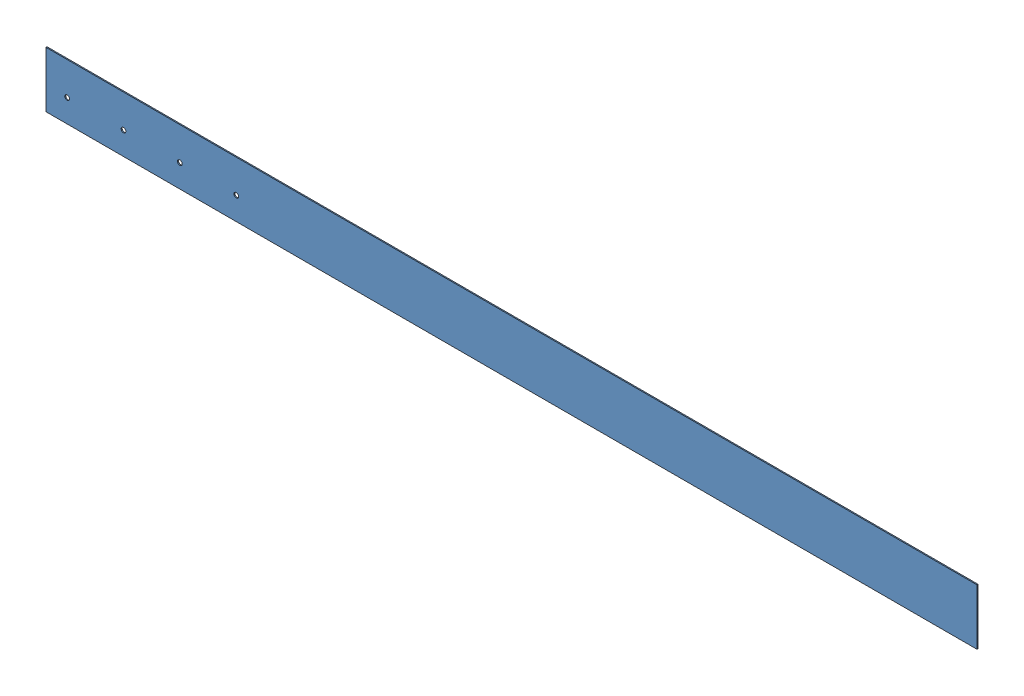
SolidWorks assembly Assem1.SLDASM, configuration Default (file format 3400). Lengths in mm.
Overall size (8816.65 528.54 10).
2 component instances, 2 part files, 0 mates.
Components (placement in the parent):
- Part3-1: Part3.SLDPRT [Default] at origin size (8816.65 528.54 10)
- Part4-1: Part4.SLDPRT [Default] at (6982.2937 -1077.3076 5135.4946) (suppressed, hidden)
